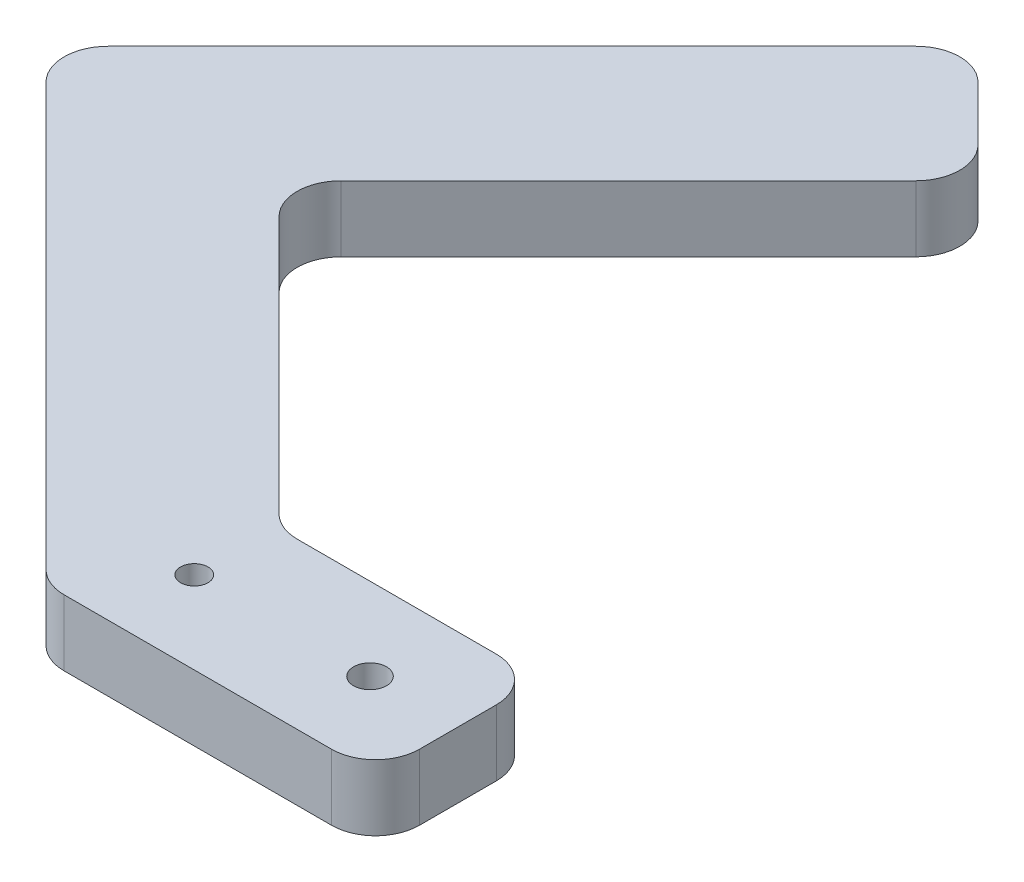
from build123d import *

# Parameters (mm, degrees)
IZIM1_R                     = 1.5
IZIM1_R_2                   = 1.25
Y_KSEKLIK_EKSTR_ZYON1_DEPTH = 6
RADYUS1_R                   = 4


with BuildPart() as part:
    # izim1 → Y_kseklik-Ekstr_zyon1 (new body)
    with BuildSketch(Plane(origin=(0, 0, 0), x_dir=(1, 0, 0), z_dir=(0, 1, 0))):
        Polygon((0, 0), (0, 15), (-23.786796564, 15), (-51.213203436, 42.426406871), (-19.393398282, 74.246212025), (-30, 84.852813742), (-72.426406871, 42.426406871), (-30, 0), align=None)
        with Locations(Location((-8, 7.5, 0), (0, 0, 270))):
            Circle(IZIM1_R, mode=Mode.SUBTRACT)
        with Locations(Location((-24, 7.5, 0), (0, 0, 270))):
            Circle(IZIM1_R_2, mode=Mode.SUBTRACT)
    extrude(amount=Y_KSEKLIK_EKSTR_ZYON1_DEPTH)

    # Radyus1
    radyus1_edges = [part.edges().sort_by_distance(p)[0] for p in [
        (-30, 3, 0),
        (-72.426406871, 3, -42.426406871),
        (-30, 3, -84.852813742),
        (-19.393398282, 3, -74.246212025),
        (-51.213203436, 3, -42.426406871),
        (-23.786796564, 3, -15),
        (0, 3, -15),
        (0, 3, 0),
    ]]
    fillet(radyus1_edges, radius=RADYUS1_R)


solid = part.part
